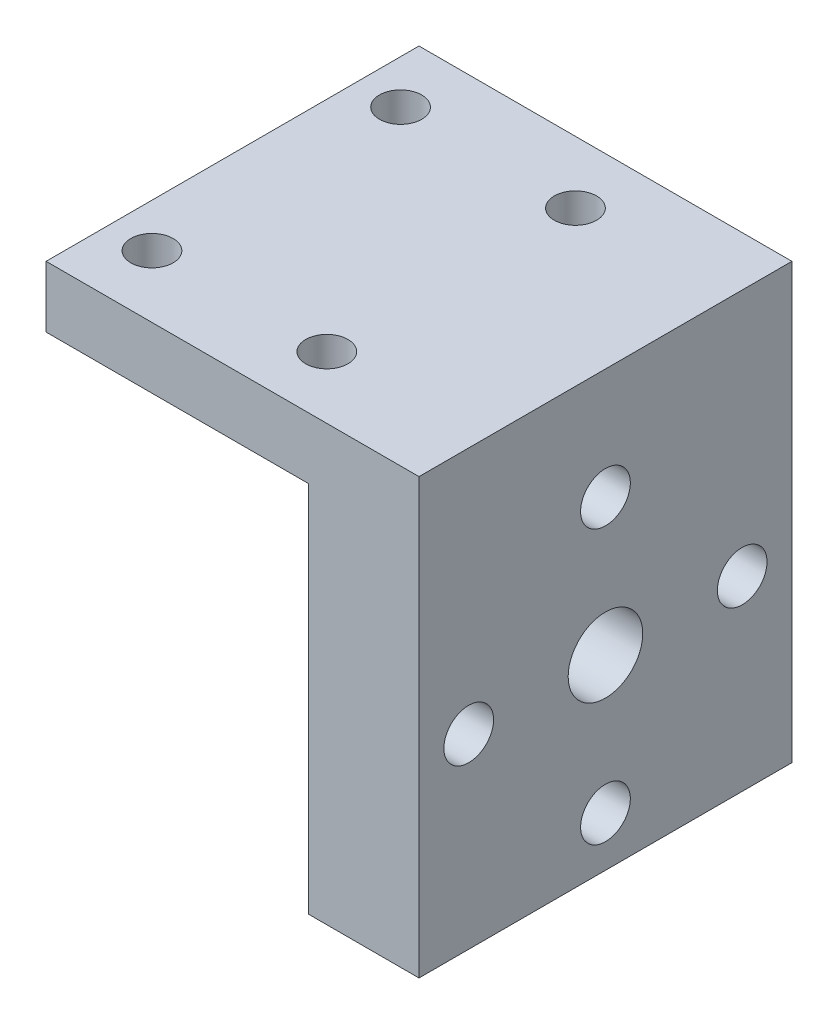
from build123d import *

# Parameters (mm, degrees)
BOSS_EXTRUDE1_DEPTH = 30
SKETCH2_R           = 8.95
CUT_EXTRUDE1_DEPTH  = 2
SKETCH4_R           = 3
SKETCH4_R_2         = 2
CUT_EXTRUDE8_DEPTH  = 51.651593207
SKETCH5_R           = 1.7
CUT_EXTRUDE9_DEPTH  = 48.385033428


with BuildPart() as part:
    # Sketch1 → Boss-Extrude1 (new body)
    with BuildSketch(Plane.XY):
        Polygon((0, 0), (8.896886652, 0), (8.896886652, 30), (8.896886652, 34.931969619), (-21.103113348, 34.931969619), (-21.103113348, 30), (0, 30), align=None)
    extrude(amount=BOSS_EXTRUDE1_DEPTH)

    # Sketch2 → Cut-Extrude1 (cut)
    with BuildSketch(Plane.ZY):
        with Locations((15, 15)):
            Circle(SKETCH2_R)
    extrude(amount=-CUT_EXTRUDE1_DEPTH, mode=Mode.SUBTRACT)

    # Sketch4 → Cut-Extrude8 (cut, through all)
    with BuildSketch(Plane.ZY):
        with Locations((15, 15)):
            Circle(SKETCH4_R)
        with Locations((15, 26)):
            Circle(SKETCH4_R_2)
        with Locations((26, 15)):
            Circle(SKETCH4_R_2)
        with Locations((15, 4)):
            Circle(SKETCH4_R_2)
        with Locations((4, 15)):
            Circle(SKETCH4_R_2)
    extrude(amount=-CUT_EXTRUDE8_DEPTH, mode=Mode.SUBTRACT)

    # Sketch5 → Cut-Extrude9 (cut, through all)
    with BuildSketch(Plane.XZ.offset(-30)):
        with Locations(Location((-17.58592779, 25, 0), (0, 0, 270))):
            Circle(SKETCH5_R)
        with Locations(Location((-3.517185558, 25, 0), (0, 0, 270))):
            Circle(SKETCH5_R)
        with Locations(Location((-3.517185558, 5, 0), (0, 0, 270))):
            Circle(SKETCH5_R)
        with Locations(Location((-17.58592779, 5, 0), (0, 0, 270))):
            Circle(SKETCH5_R)
    extrude(amount=-CUT_EXTRUDE9_DEPTH, mode=Mode.SUBTRACT)


solid = part.part
